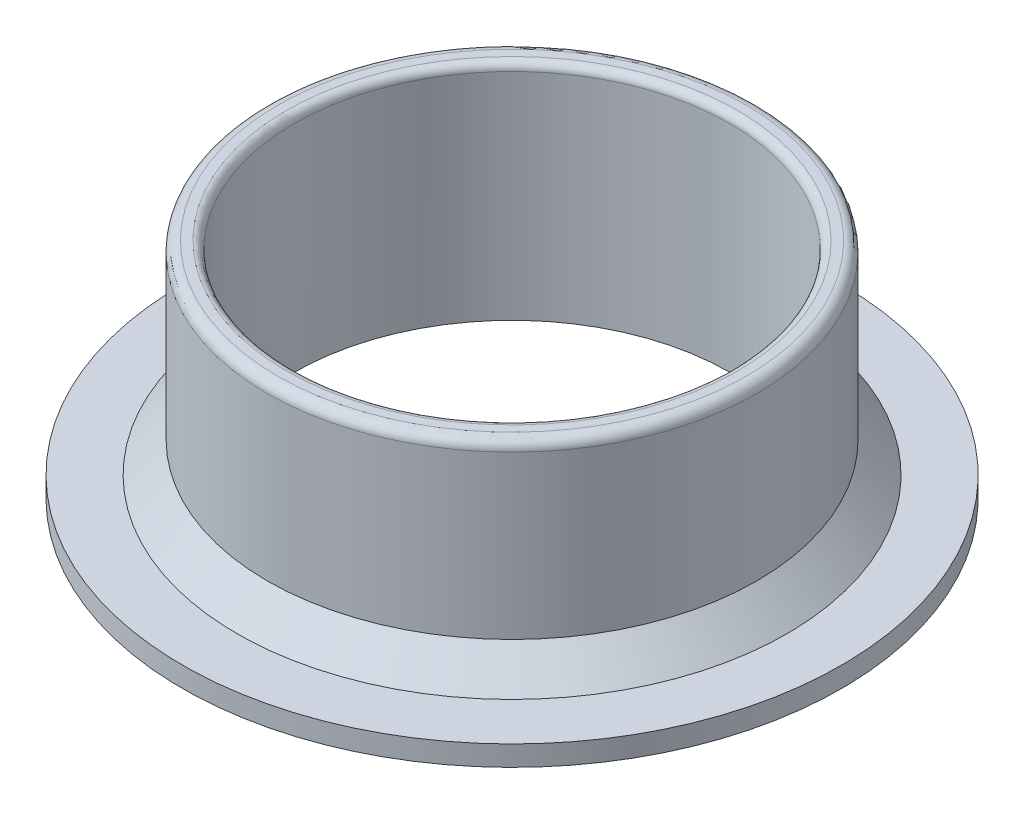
from build123d import *
from build123d.topology import SkipClean

# Parameters (mm, degrees)
SKETCH1_R           = 24.125
SKETCH1_R_2         = 21.5
BOSS_EXTRUDE1_DEPTH = 10
BOSS_EXTRUDE2_START = 2
SKETCH5_R           = 32.5
SKETCH5_R_2         = 21.5
BOSS_EXTRUDE2_DEPTH = 2
CHAMFER1_SIZE       = 3
FILLET1_R           = 1
FILLET2_R           = 0.75


with BuildPart() as part:
    # Sketch1 → Boss-Extrude1 (new, symmetric)
    with BuildSketch(Plane(origin=(0, 0, 0), x_dir=(1, 0, 0), z_dir=(0, 1, 0))):
        with Locations(Location((0, 0, 0), (0, 0, 270))):
            Circle(SKETCH1_R)
        with Locations(Location((0, 0, 0), (0, 0, 270))):
            Circle(SKETCH1_R_2, mode=Mode.SUBTRACT)
    extrude(amount=BOSS_EXTRUDE1_DEPTH, both=True)

    # Sketch5 → Boss-Extrude2 (add)
    with SkipClean():  # the faces are left unmerged after this step: merging them gives an invalid solid
        with BuildSketch(Plane.XZ.offset(10).offset(BOSS_EXTRUDE2_START)):
            with Locations(Location((0, 0, 0), (0, 0, 270))):
                Circle(SKETCH5_R)
            with Locations(Location((0, 0, 0), (0, 0, 270))):
                Circle(SKETCH5_R_2, mode=Mode.SUBTRACT)
        extrude(amount=-BOSS_EXTRUDE2_DEPTH)

    # Chamfer1
    chamfer1_edges = [part.edges().sort_by_distance(p)[0] for p in [
        (0, -10, -24.125),
    ]]
    chamfer(chamfer1_edges, length=CHAMFER1_SIZE)

    # Fillet1
    fillet1_edges = [part.edges().sort_by_distance(p)[0] for p in [
        (0, 10, -24.125),
    ]]
    fillet(fillet1_edges, radius=FILLET1_R)

    # Fillet2
    fillet2_edges = [part.edges().sort_by_distance(p)[0] for p in [
        (0, 10, -21.5),
    ]]
    fillet(fillet2_edges, radius=FILLET2_R)


solid = part.part
